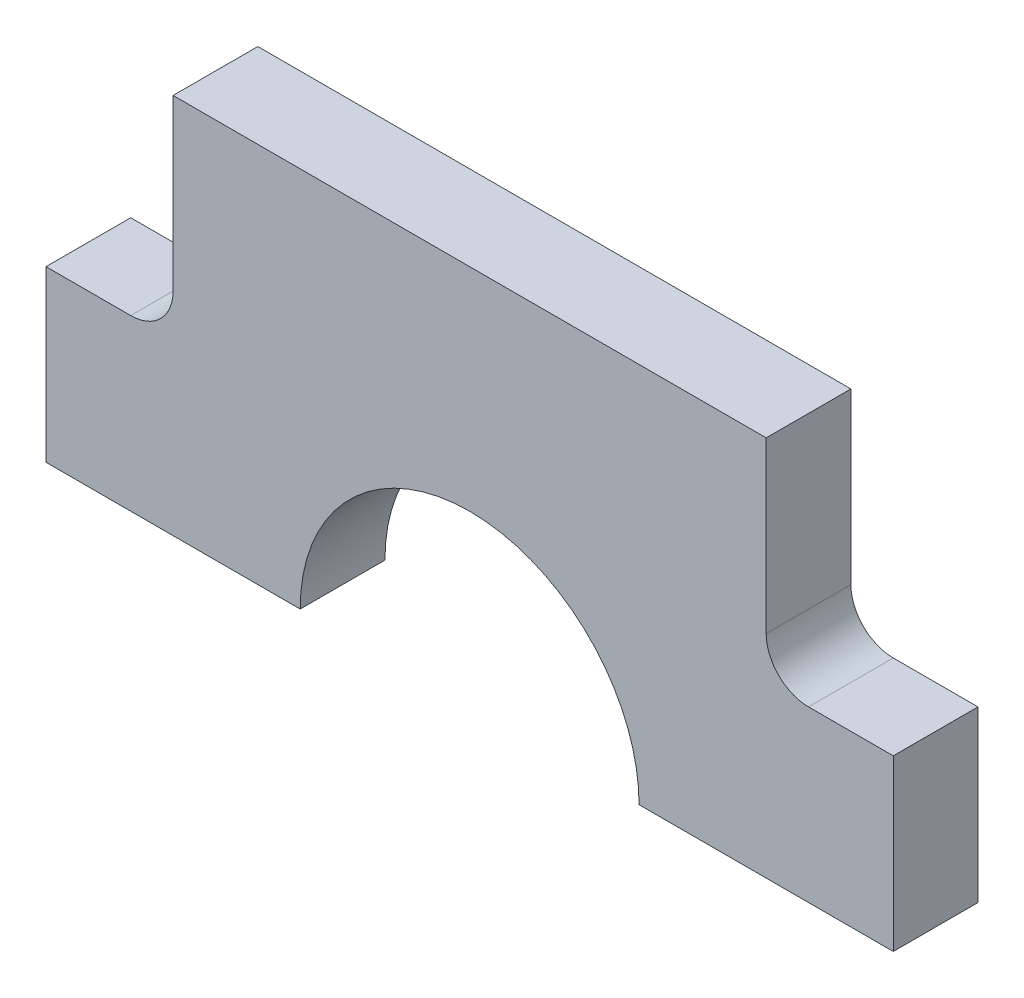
from build123d import *

# Parameters (mm, degrees)
BOSS_EXTRUDE1_DEPTH = 2.54


with BuildPart() as part:
    # Sketch1 → Boss-Extrude1 (new body)
    with BuildSketch(Plane.XY):
        with BuildLine():
            Line((0, 0), (7.62, 0))
            ThreePointArc((7.62, 0), (12.7, 5.08), (17.78, 0))
            Line((17.78, 0), (25.4, 0))
            Line((25.4, 0), (25.4, 5.08))
            Line((25.4, 5.08), (22.86, 5.08))
            ThreePointArc((22.86, 5.08), (21.961974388, 5.451974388), (21.59, 6.35))
            Line((21.59, 6.35), (21.59, 11.43))
            Line((21.59, 11.43), (3.81, 11.43))
            Line((3.81, 11.43), (3.81, 6.35))
            ThreePointArc((3.81, 6.35), (3.438025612, 5.451974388), (2.54, 5.08))
            Line((2.54, 5.08), (0, 5.08))
            Line((0, 5.08), (0, 0))
        make_face()
    extrude(amount=BOSS_EXTRUDE1_DEPTH)


solid = part.part
